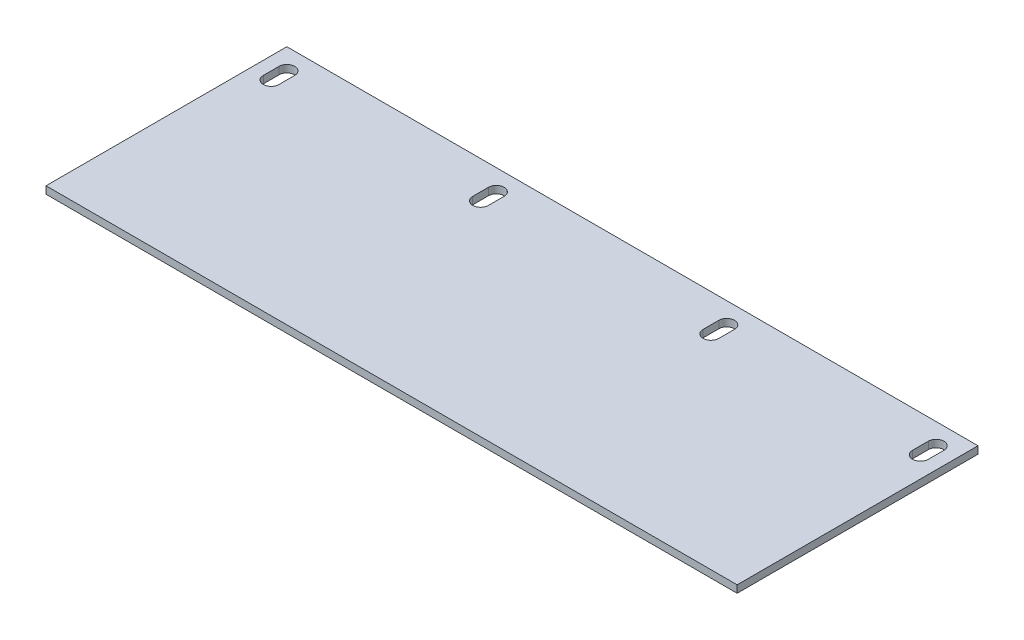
ISO-10303-21;
HEADER;
FILE_DESCRIPTION(('STEP AP214'),'2;1');
FILE_NAME('part.step','',(''),(''),'','','');
FILE_SCHEMA(('AUTOMOTIVE_DESIGN { 1 0 10303 214 1 1 1 1 }'));
ENDSEC;
DATA;
#1=APPLICATION_CONTEXT('core data for automotive mechanical design processes');
#2=APPLICATION_PROTOCOL_DEFINITION('international standard','automotive_design',2000,#1);
#3=PRODUCT_CONTEXT('',#1,'mechanical');
#4=PRODUCT('Part','Part','',(#3));
#5=PRODUCT_RELATED_PRODUCT_CATEGORY('part','',(#4));
#6=PRODUCT_DEFINITION_FORMATION('','',#4);
#7=PRODUCT_DEFINITION_CONTEXT('part definition',#1,'design');
#8=PRODUCT_DEFINITION('design','',#6,#7);
#9=PRODUCT_DEFINITION_SHAPE('','',#8);
#10=(LENGTH_UNIT() NAMED_UNIT(*) SI_UNIT(.MILLI.,.METRE.));
#11=(NAMED_UNIT(*) PLANE_ANGLE_UNIT() SI_UNIT($,.RADIAN.));
#12=(NAMED_UNIT(*) SI_UNIT($,.STERADIAN.) SOLID_ANGLE_UNIT());
#13=UNCERTAINTY_MEASURE_WITH_UNIT(LENGTH_MEASURE(1.E-05),#10,'distance_accuracy_value','');
#14=(GEOMETRIC_REPRESENTATION_CONTEXT(3) GLOBAL_UNCERTAINTY_ASSIGNED_CONTEXT((#13)) GLOBAL_UNIT_ASSIGNED_CONTEXT((#10,
#11,#12)) REPRESENTATION_CONTEXT('',''));
#15=CARTESIAN_POINT('',(0.,0.,0.));
#16=DIRECTION('',(0.,0.,1.));
#17=DIRECTION('',(1.,0.,0.));
#18=AXIS2_PLACEMENT_3D('',#15,#16,#17);
#19=CARTESIAN_POINT('',(838.2,17.8562000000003,-292.1));
#20=DIRECTION('',(-1.,0.,0.));
#21=DIRECTION('',(0.,0.,1.));
#22=AXIS2_PLACEMENT_3D('',#19,#20,#21);
#23=PLANE('',#22);
#24=DIRECTION('',(0.,0.,-1.));
#25=VECTOR('',#24,1.);
#26=CARTESIAN_POINT('',(838.2,3.33066907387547E-13,-292.1));
#27=LINE('',#26,#25);
#28=CARTESIAN_POINT('',(838.2,-4.71844785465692E-13,292.1));
#29=VERTEX_POINT('',#28);
#30=CARTESIAN_POINT('',(838.2,3.33066907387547E-13,-292.1));
#31=VERTEX_POINT('',#30);
#32=EDGE_CURVE('E205',#29,#31,#27,.T.);
#33=ORIENTED_EDGE('',*,*,#32,.T.);
#34=DIRECTION('',(0.,-1.,0.));
#35=VECTOR('',#34,1.);
#36=CARTESIAN_POINT('',(838.2,17.8562000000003,-292.1));
#37=LINE('',#36,#35);
#38=CARTESIAN_POINT('',(838.2,17.8562000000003,-292.1));
#39=VERTEX_POINT('',#38);
#40=EDGE_CURVE('E11',#39,#31,#37,.T.);
#41=ORIENTED_EDGE('',*,*,#40,.F.);
#42=DIRECTION('',(0.,0.,-1.));
#43=VECTOR('',#42,1.);
#44=CARTESIAN_POINT('',(838.2,17.8562000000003,-292.1));
#45=LINE('',#44,#43);
#46=CARTESIAN_POINT('',(838.2,17.8561999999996,292.1));
#47=VERTEX_POINT('',#46);
#48=EDGE_CURVE('E302',#47,#39,#45,.T.);
#49=ORIENTED_EDGE('',*,*,#48,.F.);
#50=DIRECTION('',(0.,-1.,0.));
#51=VECTOR('',#50,1.);
#52=CARTESIAN_POINT('',(838.2,17.8561999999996,292.1));
#53=LINE('',#52,#51);
#54=EDGE_CURVE('E312',#47,#29,#53,.T.);
#55=ORIENTED_EDGE('',*,*,#54,.T.);
#56=EDGE_LOOP('',(#33,#41,#49,#55));
#57=FACE_BOUND('',#56,.T.);
#58=ADVANCED_FACE('F32',(#57),#23,.F.);
#59=CARTESIAN_POINT('',(-838.2,17.8562000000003,-292.1));
#60=DIRECTION('',(0.,0.,1.));
#61=DIRECTION('',(1.,0.,0.));
#62=AXIS2_PLACEMENT_3D('',#59,#60,#61);
#63=PLANE('',#62);
#64=DIRECTION('',(-1.,0.,0.));
#65=VECTOR('',#64,1.);
#66=CARTESIAN_POINT('',(-838.2,3.33066907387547E-13,-292.1));
#67=LINE('',#66,#65);
#68=CARTESIAN_POINT('',(-838.2,3.33066907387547E-13,-292.1));
#69=VERTEX_POINT('',#68);
#70=EDGE_CURVE('E315',#31,#69,#67,.T.);
#71=ORIENTED_EDGE('',*,*,#70,.T.);
#72=DIRECTION('',(0.,-1.,0.));
#73=VECTOR('',#72,1.);
#74=CARTESIAN_POINT('',(-838.2,17.8562000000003,-292.1));
#75=LINE('',#74,#73);
#76=CARTESIAN_POINT('',(-838.2,17.8562000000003,-292.1));
#77=VERTEX_POINT('',#76);
#78=EDGE_CURVE('E39',#77,#69,#75,.T.);
#79=ORIENTED_EDGE('',*,*,#78,.F.);
#80=DIRECTION('',(-1.,0.,0.));
#81=VECTOR('',#80,1.);
#82=CARTESIAN_POINT('',(-838.2,17.8562000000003,-292.1));
#83=LINE('',#82,#81);
#84=EDGE_CURVE('E305',#39,#77,#83,.T.);
#85=ORIENTED_EDGE('',*,*,#84,.F.);
#86=ORIENTED_EDGE('',*,*,#40,.T.);
#87=EDGE_LOOP('',(#71,#79,#85,#86));
#88=FACE_BOUND('',#87,.T.);
#89=ADVANCED_FACE('F344',(#88),#63,.F.);
#90=CARTESIAN_POINT('',(-838.2,17.8562000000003,-292.1));
#91=DIRECTION('',(1.,0.,0.));
#92=DIRECTION('',(0.,0.,-1.));
#93=AXIS2_PLACEMENT_3D('',#90,#91,#92);
#94=PLANE('',#93);
#95=DIRECTION('',(0.,0.,1.));
#96=VECTOR('',#95,1.);
#97=CARTESIAN_POINT('',(-838.2,3.33066907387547E-13,-292.1));
#98=LINE('',#97,#96);
#99=CARTESIAN_POINT('',(-838.2,-4.71844785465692E-13,292.1));
#100=VERTEX_POINT('',#99);
#101=EDGE_CURVE('E317',#69,#100,#98,.T.);
#102=ORIENTED_EDGE('',*,*,#101,.T.);
#103=DIRECTION('',(0.,-1.,0.));
#104=VECTOR('',#103,1.);
#105=CARTESIAN_POINT('',(-838.2,17.8561999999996,292.1));
#106=LINE('',#105,#104);
#107=CARTESIAN_POINT('',(-838.2,17.8561999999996,292.1));
#108=VERTEX_POINT('',#107);
#109=EDGE_CURVE('E322',#108,#100,#106,.T.);
#110=ORIENTED_EDGE('',*,*,#109,.F.);
#111=DIRECTION('',(0.,0.,1.));
#112=VECTOR('',#111,1.);
#113=CARTESIAN_POINT('',(-838.2,17.8562000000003,-292.1));
#114=LINE('',#113,#112);
#115=EDGE_CURVE('E308',#77,#108,#114,.T.);
#116=ORIENTED_EDGE('',*,*,#115,.F.);
#117=ORIENTED_EDGE('',*,*,#78,.T.);
#118=EDGE_LOOP('',(#102,#110,#116,#117));
#119=FACE_BOUND('',#118,.T.);
#120=ADVANCED_FACE('F329',(#119),#94,.F.);
#121=CARTESIAN_POINT('',(-838.2,17.8561999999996,292.1));
#122=DIRECTION('',(0.,0.,-1.));
#123=DIRECTION('',(-1.,0.,0.));
#124=AXIS2_PLACEMENT_3D('',#121,#122,#123);
#125=PLANE('',#124);
#126=DIRECTION('',(1.,0.,0.));
#127=VECTOR('',#126,1.);
#128=CARTESIAN_POINT('',(-838.2,-4.71844785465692E-13,292.1));
#129=LINE('',#128,#127);
#130=EDGE_CURVE('E306',#100,#29,#129,.T.);
#131=ORIENTED_EDGE('',*,*,#130,.T.);
#132=ORIENTED_EDGE('',*,*,#54,.F.);
#133=DIRECTION('',(1.,0.,0.));
#134=VECTOR('',#133,1.);
#135=CARTESIAN_POINT('',(-838.2,17.8561999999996,292.1));
#136=LINE('',#135,#134);
#137=EDGE_CURVE('E310',#108,#47,#136,.T.);
#138=ORIENTED_EDGE('',*,*,#137,.F.);
#139=ORIENTED_EDGE('',*,*,#109,.T.);
#140=EDGE_LOOP('',(#131,#132,#138,#139));
#141=FACE_BOUND('',#140,.T.);
#142=ADVANCED_FACE('F337',(#141),#125,.F.);
#143=CARTESIAN_POINT('',(0.,17.8561999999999,0.));
#144=DIRECTION('',(0.,1.,0.));
#145=DIRECTION('',(0.,0.,1.));
#146=AXIS2_PLACEMENT_3D('',#143,#144,#145);
#147=PLANE('',#146);
#148=CARTESIAN_POINT('',(-787.4,17.8562000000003,-241.3));
#149=DIRECTION('',(0.,1.,0.));
#150=DIRECTION('',(0.,0.,1.));
#151=AXIS2_PLACEMENT_3D('',#148,#149,#150);
#152=CIRCLE('',#151,19.05);
#153=CARTESIAN_POINT('',(-768.35,17.8562000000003,-241.3));
#154=VERTEX_POINT('',#153);
#155=CARTESIAN_POINT('',(-806.45,17.8562000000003,-241.3));
#156=VERTEX_POINT('',#155);
#157=EDGE_CURVE('E46',#154,#156,#152,.T.);
#158=ORIENTED_EDGE('',*,*,#157,.F.);
#159=DIRECTION('',(0.,0.,-1.));
#160=VECTOR('',#159,1.);
#161=CARTESIAN_POINT('',(-768.35,17.8562000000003,-241.3));
#162=LINE('',#161,#160);
#163=CARTESIAN_POINT('',(-768.35,17.8562000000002,-203.2));
#164=VERTEX_POINT('',#163);
#165=EDGE_CURVE('E189',#164,#154,#162,.T.);
#166=ORIENTED_EDGE('',*,*,#165,.F.);
#167=CARTESIAN_POINT('',(-787.4,17.8562000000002,-203.2));
#168=DIRECTION('',(0.,1.,0.));
#169=DIRECTION('',(0.,0.,1.));
#170=AXIS2_PLACEMENT_3D('',#167,#168,#169);
#171=CIRCLE('',#170,19.05);
#172=CARTESIAN_POINT('',(-806.45,17.8562000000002,-203.2));
#173=VERTEX_POINT('',#172);
#174=EDGE_CURVE('E192',#173,#164,#171,.T.);
#175=ORIENTED_EDGE('',*,*,#174,.F.);
#176=DIRECTION('',(0.,0.,1.));
#177=VECTOR('',#176,1.);
#178=CARTESIAN_POINT('',(-806.45,17.8562000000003,-241.3));
#179=LINE('',#178,#177);
#180=EDGE_CURVE('E198',#156,#173,#179,.T.);
#181=ORIENTED_EDGE('',*,*,#180,.F.);
#182=EDGE_LOOP('',(#158,#166,#175,#181));
#183=FACE_BOUND('',#182,.T.);
#184=CARTESIAN_POINT('',(279.4,17.8562000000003,-241.3));
#185=DIRECTION('',(0.,1.,0.));
#186=DIRECTION('',(0.,0.,-1.));
#187=AXIS2_PLACEMENT_3D('',#184,#185,#186);
#188=CIRCLE('',#187,19.0499999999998);
#189=CARTESIAN_POINT('',(298.45,17.8562000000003,-241.3));
#190=VERTEX_POINT('',#189);
#191=CARTESIAN_POINT('',(260.35,17.8562000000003,-241.3));
#192=VERTEX_POINT('',#191);
#193=EDGE_CURVE('E54',#190,#192,#188,.T.);
#194=ORIENTED_EDGE('',*,*,#193,.F.);
#195=DIRECTION('',(0.,0.,-1.));
#196=VECTOR('',#195,1.);
#197=CARTESIAN_POINT('',(298.45,17.8562000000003,-241.3));
#198=LINE('',#197,#196);
#199=CARTESIAN_POINT('',(298.45,17.8562000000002,-203.2));
#200=VERTEX_POINT('',#199);
#201=EDGE_CURVE('E213',#200,#190,#198,.T.);
#202=ORIENTED_EDGE('',*,*,#201,.F.);
#203=CARTESIAN_POINT('',(279.4,17.8562000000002,-203.2));
#204=DIRECTION('',(0.,1.,0.));
#205=DIRECTION('',(0.,0.,-1.));
#206=AXIS2_PLACEMENT_3D('',#203,#204,#205);
#207=CIRCLE('',#206,19.0499999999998);
#208=CARTESIAN_POINT('',(260.35,17.8562000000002,-203.2));
#209=VERTEX_POINT('',#208);
#210=EDGE_CURVE('E228',#209,#200,#207,.T.);
#211=ORIENTED_EDGE('',*,*,#210,.F.);
#212=DIRECTION('',(0.,0.,1.));
#213=VECTOR('',#212,1.);
#214=CARTESIAN_POINT('',(260.35,17.8562000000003,-241.3));
#215=LINE('',#214,#213);
#216=EDGE_CURVE('E224',#192,#209,#215,.T.);
#217=ORIENTED_EDGE('',*,*,#216,.F.);
#218=EDGE_LOOP('',(#194,#202,#211,#217));
#219=FACE_BOUND('',#218,.T.);
#220=CARTESIAN_POINT('',(-279.4,17.8562000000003,-241.3));
#221=DIRECTION('',(0.,1.,0.));
#222=DIRECTION('',(0.,0.,1.));
#223=AXIS2_PLACEMENT_3D('',#220,#221,#222);
#224=CIRCLE('',#223,19.05);
#225=CARTESIAN_POINT('',(-260.35,17.8562000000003,-241.3));
#226=VERTEX_POINT('',#225);
#227=CARTESIAN_POINT('',(-298.45,17.8562000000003,-241.3));
#228=VERTEX_POINT('',#227);
#229=EDGE_CURVE('E253',#226,#228,#224,.T.);
#230=ORIENTED_EDGE('',*,*,#229,.F.);
#231=DIRECTION('',(0.,0.,-1.));
#232=VECTOR('',#231,1.);
#233=CARTESIAN_POINT('',(-260.35,17.8562000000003,-241.3));
#234=LINE('',#233,#232);
#235=CARTESIAN_POINT('',(-260.35,17.8562000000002,-203.2));
#236=VERTEX_POINT('',#235);
#237=EDGE_CURVE('E243',#236,#226,#234,.T.);
#238=ORIENTED_EDGE('',*,*,#237,.F.);
#239=CARTESIAN_POINT('',(-279.4,17.8562000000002,-203.2));
#240=DIRECTION('',(0.,1.,0.));
#241=DIRECTION('',(0.,0.,1.));
#242=AXIS2_PLACEMENT_3D('',#239,#240,#241);
#243=CIRCLE('',#242,19.05);
#244=CARTESIAN_POINT('',(-298.45,17.8562000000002,-203.2));
#245=VERTEX_POINT('',#244);
#246=EDGE_CURVE('E259',#245,#236,#243,.T.);
#247=ORIENTED_EDGE('',*,*,#246,.F.);
#248=DIRECTION('',(0.,0.,1.));
#249=VECTOR('',#248,1.);
#250=CARTESIAN_POINT('',(-298.45,17.8562000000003,-241.3));
#251=LINE('',#250,#249);
#252=EDGE_CURVE('E255',#228,#245,#251,.T.);
#253=ORIENTED_EDGE('',*,*,#252,.F.);
#254=EDGE_LOOP('',(#230,#238,#247,#253));
#255=FACE_BOUND('',#254,.T.);
#256=CARTESIAN_POINT('',(787.4,17.8562000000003,-241.3));
#257=DIRECTION('',(0.,1.,0.));
#258=DIRECTION('',(0.,0.,-1.));
#259=AXIS2_PLACEMENT_3D('',#256,#257,#258);
#260=CIRCLE('',#259,19.05);
#261=CARTESIAN_POINT('',(806.45,17.8562000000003,-241.3));
#262=VERTEX_POINT('',#261);
#263=CARTESIAN_POINT('',(768.35,17.8562000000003,-241.3));
#264=VERTEX_POINT('',#263);
#265=EDGE_CURVE('E285',#262,#264,#260,.T.);
#266=ORIENTED_EDGE('',*,*,#265,.F.);
#267=DIRECTION('',(0.,0.,-1.));
#268=VECTOR('',#267,1.);
#269=CARTESIAN_POINT('',(806.45,17.8562000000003,-241.3));
#270=LINE('',#269,#268);
#271=CARTESIAN_POINT('',(806.45,17.8562000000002,-203.2));
#272=VERTEX_POINT('',#271);
#273=EDGE_CURVE('E275',#272,#262,#270,.T.);
#274=ORIENTED_EDGE('',*,*,#273,.F.);
#275=CARTESIAN_POINT('',(787.4,17.8562000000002,-203.2));
#276=DIRECTION('',(0.,1.,0.));
#277=DIRECTION('',(0.,0.,-1.));
#278=AXIS2_PLACEMENT_3D('',#275,#276,#277);
#279=CIRCLE('',#278,19.05);
#280=CARTESIAN_POINT('',(768.35,17.8562000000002,-203.2));
#281=VERTEX_POINT('',#280);
#282=EDGE_CURVE('E290',#281,#272,#279,.T.);
#283=ORIENTED_EDGE('',*,*,#282,.F.);
#284=DIRECTION('',(0.,0.,1.));
#285=VECTOR('',#284,1.);
#286=CARTESIAN_POINT('',(768.35,17.8562000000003,-241.3));
#287=LINE('',#286,#285);
#288=EDGE_CURVE('E287',#264,#281,#287,.T.);
#289=ORIENTED_EDGE('',*,*,#288,.F.);
#290=EDGE_LOOP('',(#266,#274,#283,#289));
#291=FACE_BOUND('',#290,.T.);
#292=ORIENTED_EDGE('',*,*,#48,.T.);
#293=ORIENTED_EDGE('',*,*,#84,.T.);
#294=ORIENTED_EDGE('',*,*,#115,.T.);
#295=ORIENTED_EDGE('',*,*,#137,.T.);
#296=EDGE_LOOP('',(#292,#293,#294,#295));
#297=FACE_BOUND('',#296,.T.);
#298=ADVANCED_FACE('F343',(#183,#219,#255,#291,#297),#147,.T.);
#299=CARTESIAN_POINT('',(0.,0.,0.));
#300=DIRECTION('',(0.,1.,0.));
#301=DIRECTION('',(0.,0.,1.));
#302=AXIS2_PLACEMENT_3D('',#299,#300,#301);
#303=PLANE('',#302);
#304=DIRECTION('',(0.,0.,-1.));
#305=VECTOR('',#304,1.);
#306=CARTESIAN_POINT('',(-768.35,3.33066907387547E-13,-241.3));
#307=LINE('',#306,#305);
#308=CARTESIAN_POINT('',(-768.35,1.94289029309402E-13,-203.2));
#309=VERTEX_POINT('',#308);
#310=CARTESIAN_POINT('',(-768.35,3.33066907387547E-13,-241.3));
#311=VERTEX_POINT('',#310);
#312=EDGE_CURVE('E176',#309,#311,#307,.T.);
#313=ORIENTED_EDGE('',*,*,#312,.T.);
#314=CARTESIAN_POINT('',(-787.4,3.33066907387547E-13,-241.3));
#315=DIRECTION('',(0.,1.,0.));
#316=DIRECTION('',(0.,0.,1.));
#317=AXIS2_PLACEMENT_3D('',#314,#315,#316);
#318=CIRCLE('',#317,19.05);
#319=CARTESIAN_POINT('',(-806.45,3.33066907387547E-13,-241.3));
#320=VERTEX_POINT('',#319);
#321=EDGE_CURVE('E170',#311,#320,#318,.T.);
#322=ORIENTED_EDGE('',*,*,#321,.T.);
#323=DIRECTION('',(0.,0.,1.));
#324=VECTOR('',#323,1.);
#325=CARTESIAN_POINT('',(-806.45,3.33066907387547E-13,-241.3));
#326=LINE('',#325,#324);
#327=CARTESIAN_POINT('',(-806.45,1.94289029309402E-13,-203.2));
#328=VERTEX_POINT('',#327);
#329=EDGE_CURVE('E180',#320,#328,#326,.T.);
#330=ORIENTED_EDGE('',*,*,#329,.T.);
#331=CARTESIAN_POINT('',(-787.4,1.94289029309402E-13,-203.2));
#332=DIRECTION('',(0.,1.,0.));
#333=DIRECTION('',(0.,0.,1.));
#334=AXIS2_PLACEMENT_3D('',#331,#332,#333);
#335=CIRCLE('',#334,19.05);
#336=EDGE_CURVE('E184',#328,#309,#335,.T.);
#337=ORIENTED_EDGE('',*,*,#336,.T.);
#338=EDGE_LOOP('',(#313,#322,#330,#337));
#339=FACE_BOUND('',#338,.T.);
#340=DIRECTION('',(0.,0.,-1.));
#341=VECTOR('',#340,1.);
#342=CARTESIAN_POINT('',(298.45,3.33066907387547E-13,-241.3));
#343=LINE('',#342,#341);
#344=CARTESIAN_POINT('',(298.45,1.94289029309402E-13,-203.2));
#345=VERTEX_POINT('',#344);
#346=CARTESIAN_POINT('',(298.45,3.33066907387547E-13,-241.3));
#347=VERTEX_POINT('',#346);
#348=EDGE_CURVE('E219',#345,#347,#343,.T.);
#349=ORIENTED_EDGE('',*,*,#348,.T.);
#350=CARTESIAN_POINT('',(279.4,3.33066907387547E-13,-241.3));
#351=DIRECTION('',(0.,1.,0.));
#352=DIRECTION('',(0.,0.,-1.));
#353=AXIS2_PLACEMENT_3D('',#350,#351,#352);
#354=CIRCLE('',#353,19.0499999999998);
#355=CARTESIAN_POINT('',(260.35,3.33066907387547E-13,-241.3));
#356=VERTEX_POINT('',#355);
#357=EDGE_CURVE('E209',#347,#356,#354,.T.);
#358=ORIENTED_EDGE('',*,*,#357,.T.);
#359=DIRECTION('',(0.,0.,1.));
#360=VECTOR('',#359,1.);
#361=CARTESIAN_POINT('',(260.35,3.33066907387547E-13,-241.3));
#362=LINE('',#361,#360);
#363=CARTESIAN_POINT('',(260.35,1.94289029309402E-13,-203.2));
#364=VERTEX_POINT('',#363);
#365=EDGE_CURVE('E212',#356,#364,#362,.T.);
#366=ORIENTED_EDGE('',*,*,#365,.T.);
#367=CARTESIAN_POINT('',(279.4,1.94289029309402E-13,-203.2));
#368=DIRECTION('',(0.,1.,0.));
#369=DIRECTION('',(0.,0.,-1.));
#370=AXIS2_PLACEMENT_3D('',#367,#368,#369);
#371=CIRCLE('',#370,19.0499999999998);
#372=EDGE_CURVE('E216',#364,#345,#371,.T.);
#373=ORIENTED_EDGE('',*,*,#372,.T.);
#374=EDGE_LOOP('',(#349,#358,#366,#373));
#375=FACE_BOUND('',#374,.T.);
#376=DIRECTION('',(0.,0.,-1.));
#377=VECTOR('',#376,1.);
#378=CARTESIAN_POINT('',(-260.35,3.33066907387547E-13,-241.3));
#379=LINE('',#378,#377);
#380=CARTESIAN_POINT('',(-260.35,1.94289029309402E-13,-203.2));
#381=VERTEX_POINT('',#380);
#382=CARTESIAN_POINT('',(-260.35,3.33066907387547E-13,-241.3));
#383=VERTEX_POINT('',#382);
#384=EDGE_CURVE('E249',#381,#383,#379,.T.);
#385=ORIENTED_EDGE('',*,*,#384,.T.);
#386=CARTESIAN_POINT('',(-279.4,3.33066907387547E-13,-241.3));
#387=DIRECTION('',(0.,1.,0.));
#388=DIRECTION('',(0.,0.,1.));
#389=AXIS2_PLACEMENT_3D('',#386,#387,#388);
#390=CIRCLE('',#389,19.05);
#391=CARTESIAN_POINT('',(-298.45,3.33066907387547E-13,-241.3));
#392=VERTEX_POINT('',#391);
#393=EDGE_CURVE('E239',#383,#392,#390,.T.);
#394=ORIENTED_EDGE('',*,*,#393,.T.);
#395=DIRECTION('',(0.,0.,1.));
#396=VECTOR('',#395,1.);
#397=CARTESIAN_POINT('',(-298.45,3.33066907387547E-13,-241.3));
#398=LINE('',#397,#396);
#399=CARTESIAN_POINT('',(-298.45,1.94289029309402E-13,-203.2));
#400=VERTEX_POINT('',#399);
#401=EDGE_CURVE('E242',#392,#400,#398,.T.);
#402=ORIENTED_EDGE('',*,*,#401,.T.);
#403=CARTESIAN_POINT('',(-279.4,1.94289029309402E-13,-203.2));
#404=DIRECTION('',(0.,1.,0.));
#405=DIRECTION('',(0.,0.,1.));
#406=AXIS2_PLACEMENT_3D('',#403,#404,#405);
#407=CIRCLE('',#406,19.05);
#408=EDGE_CURVE('E246',#400,#381,#407,.T.);
#409=ORIENTED_EDGE('',*,*,#408,.T.);
#410=EDGE_LOOP('',(#385,#394,#402,#409));
#411=FACE_BOUND('',#410,.T.);
#412=DIRECTION('',(0.,0.,-1.));
#413=VECTOR('',#412,1.);
#414=CARTESIAN_POINT('',(806.45,3.33066907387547E-13,-241.3));
#415=LINE('',#414,#413);
#416=CARTESIAN_POINT('',(806.45,1.94289029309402E-13,-203.2));
#417=VERTEX_POINT('',#416);
#418=CARTESIAN_POINT('',(806.45,3.33066907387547E-13,-241.3));
#419=VERTEX_POINT('',#418);
#420=EDGE_CURVE('E281',#417,#419,#415,.T.);
#421=ORIENTED_EDGE('',*,*,#420,.T.);
#422=CARTESIAN_POINT('',(787.4,3.33066907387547E-13,-241.3));
#423=DIRECTION('',(0.,1.,0.));
#424=DIRECTION('',(0.,0.,-1.));
#425=AXIS2_PLACEMENT_3D('',#422,#423,#424);
#426=CIRCLE('',#425,19.05);
#427=CARTESIAN_POINT('',(768.35,3.33066907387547E-13,-241.3));
#428=VERTEX_POINT('',#427);
#429=EDGE_CURVE('E271',#419,#428,#426,.T.);
#430=ORIENTED_EDGE('',*,*,#429,.T.);
#431=DIRECTION('',(0.,0.,1.));
#432=VECTOR('',#431,1.);
#433=CARTESIAN_POINT('',(768.35,3.33066907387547E-13,-241.3));
#434=LINE('',#433,#432);
#435=CARTESIAN_POINT('',(768.35,1.94289029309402E-13,-203.2));
#436=VERTEX_POINT('',#435);
#437=EDGE_CURVE('E274',#428,#436,#434,.T.);
#438=ORIENTED_EDGE('',*,*,#437,.T.);
#439=CARTESIAN_POINT('',(787.4,1.94289029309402E-13,-203.2));
#440=DIRECTION('',(0.,1.,0.));
#441=DIRECTION('',(0.,0.,-1.));
#442=AXIS2_PLACEMENT_3D('',#439,#440,#441);
#443=CIRCLE('',#442,19.05);
#444=EDGE_CURVE('E278',#436,#417,#443,.T.);
#445=ORIENTED_EDGE('',*,*,#444,.T.);
#446=EDGE_LOOP('',(#421,#430,#438,#445));
#447=FACE_BOUND('',#446,.T.);
#448=ORIENTED_EDGE('',*,*,#32,.F.);
#449=ORIENTED_EDGE('',*,*,#130,.F.);
#450=ORIENTED_EDGE('',*,*,#101,.F.);
#451=ORIENTED_EDGE('',*,*,#70,.F.);
#452=EDGE_LOOP('',(#448,#449,#450,#451));
#453=FACE_BOUND('',#452,.T.);
#454=ADVANCED_FACE('F186',(#339,#375,#411,#447,#453),#303,.F.);
#455=CARTESIAN_POINT('',(787.4,3.33066907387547E-13,-241.3));
#456=DIRECTION('',(0.,1.,0.));
#457=DIRECTION('',(0.,0.,1.));
#458=AXIS2_PLACEMENT_3D('',#455,#456,#457);
#459=CYLINDRICAL_SURFACE('',#458,19.05);
#460=ORIENTED_EDGE('',*,*,#265,.T.);
#461=DIRECTION('',(0.,1.,0.));
#462=VECTOR('',#461,1.);
#463=CARTESIAN_POINT('',(768.35,3.33066907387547E-13,-241.3));
#464=LINE('',#463,#462);
#465=EDGE_CURVE('E284',#428,#264,#464,.T.);
#466=ORIENTED_EDGE('',*,*,#465,.F.);
#467=ORIENTED_EDGE('',*,*,#429,.F.);
#468=DIRECTION('',(0.,1.,0.));
#469=VECTOR('',#468,1.);
#470=CARTESIAN_POINT('',(806.45,3.33066907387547E-13,-241.3));
#471=LINE('',#470,#469);
#472=EDGE_CURVE('E256',#419,#262,#471,.T.);
#473=ORIENTED_EDGE('',*,*,#472,.T.);
#474=EDGE_LOOP('',(#460,#466,#467,#473));
#475=FACE_BOUND('',#474,.T.);
#476=ADVANCED_FACE('F356',(#475),#459,.F.);
#477=CARTESIAN_POINT('',(806.45,3.33066907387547E-13,-241.3));
#478=DIRECTION('',(1.,0.,0.));
#479=DIRECTION('',(0.,0.,-1.));
#480=AXIS2_PLACEMENT_3D('',#477,#478,#479);
#481=PLANE('',#480);
#482=ORIENTED_EDGE('',*,*,#273,.T.);
#483=ORIENTED_EDGE('',*,*,#472,.F.);
#484=ORIENTED_EDGE('',*,*,#420,.F.);
#485=DIRECTION('',(0.,1.,0.));
#486=VECTOR('',#485,1.);
#487=CARTESIAN_POINT('',(806.45,1.94289029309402E-13,-203.2));
#488=LINE('',#487,#486);
#489=EDGE_CURVE('E296',#417,#272,#488,.T.);
#490=ORIENTED_EDGE('',*,*,#489,.T.);
#491=EDGE_LOOP('',(#482,#483,#484,#490));
#492=FACE_BOUND('',#491,.T.);
#493=ADVANCED_FACE('F362',(#492),#481,.F.);
#494=CARTESIAN_POINT('',(787.4,1.94289029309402E-13,-203.2));
#495=DIRECTION('',(0.,1.,0.));
#496=DIRECTION('',(0.,0.,1.));
#497=AXIS2_PLACEMENT_3D('',#494,#495,#496);
#498=CYLINDRICAL_SURFACE('',#497,19.05);
#499=ORIENTED_EDGE('',*,*,#282,.T.);
#500=ORIENTED_EDGE('',*,*,#489,.F.);
#501=ORIENTED_EDGE('',*,*,#444,.F.);
#502=DIRECTION('',(0.,1.,0.));
#503=VECTOR('',#502,1.);
#504=CARTESIAN_POINT('',(768.35,1.94289029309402E-13,-203.2));
#505=LINE('',#504,#503);
#506=EDGE_CURVE('E298',#436,#281,#505,.T.);
#507=ORIENTED_EDGE('',*,*,#506,.T.);
#508=EDGE_LOOP('',(#499,#500,#501,#507));
#509=FACE_BOUND('',#508,.T.);
#510=ADVANCED_FACE('F368',(#509),#498,.F.);
#511=CARTESIAN_POINT('',(768.35,3.33066907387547E-13,-241.3));
#512=DIRECTION('',(-1.,0.,0.));
#513=DIRECTION('',(0.,0.,1.));
#514=AXIS2_PLACEMENT_3D('',#511,#512,#513);
#515=PLANE('',#514);
#516=ORIENTED_EDGE('',*,*,#288,.T.);
#517=ORIENTED_EDGE('',*,*,#506,.F.);
#518=ORIENTED_EDGE('',*,*,#437,.F.);
#519=ORIENTED_EDGE('',*,*,#465,.T.);
#520=EDGE_LOOP('',(#516,#517,#518,#519));
#521=FACE_BOUND('',#520,.T.);
#522=ADVANCED_FACE('F364',(#521),#515,.F.);
#523=CARTESIAN_POINT('',(-279.4,3.33066907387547E-13,-241.3));
#524=DIRECTION('',(0.,1.,0.));
#525=DIRECTION('',(0.,0.,1.));
#526=AXIS2_PLACEMENT_3D('',#523,#524,#525);
#527=CYLINDRICAL_SURFACE('',#526,19.05);
#528=ORIENTED_EDGE('',*,*,#229,.T.);
#529=DIRECTION('',(0.,1.,0.));
#530=VECTOR('',#529,1.);
#531=CARTESIAN_POINT('',(-298.45,3.33066907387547E-13,-241.3));
#532=LINE('',#531,#530);
#533=EDGE_CURVE('E252',#392,#228,#532,.T.);
#534=ORIENTED_EDGE('',*,*,#533,.F.);
#535=ORIENTED_EDGE('',*,*,#393,.F.);
#536=DIRECTION('',(0.,1.,0.));
#537=VECTOR('',#536,1.);
#538=CARTESIAN_POINT('',(-260.35,3.33066907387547E-13,-241.3));
#539=LINE('',#538,#537);
#540=EDGE_CURVE('E225',#383,#226,#539,.T.);
#541=ORIENTED_EDGE('',*,*,#540,.T.);
#542=EDGE_LOOP('',(#528,#534,#535,#541));
#543=FACE_BOUND('',#542,.T.);
#544=ADVANCED_FACE('F367',(#543),#527,.F.);
#545=CARTESIAN_POINT('',(-260.35,3.33066907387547E-13,-241.3));
#546=DIRECTION('',(1.,0.,0.));
#547=DIRECTION('',(0.,0.,-1.));
#548=AXIS2_PLACEMENT_3D('',#545,#546,#547);
#549=PLANE('',#548);
#550=ORIENTED_EDGE('',*,*,#237,.T.);
#551=ORIENTED_EDGE('',*,*,#540,.F.);
#552=ORIENTED_EDGE('',*,*,#384,.F.);
#553=DIRECTION('',(0.,1.,0.));
#554=VECTOR('',#553,1.);
#555=CARTESIAN_POINT('',(-260.35,1.94289029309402E-13,-203.2));
#556=LINE('',#555,#554);
#557=EDGE_CURVE('E265',#381,#236,#556,.T.);
#558=ORIENTED_EDGE('',*,*,#557,.T.);
#559=EDGE_LOOP('',(#550,#551,#552,#558));
#560=FACE_BOUND('',#559,.T.);
#561=ADVANCED_FACE('F378',(#560),#549,.F.);
#562=CARTESIAN_POINT('',(-279.4,1.94289029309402E-13,-203.2));
#563=DIRECTION('',(0.,1.,0.));
#564=DIRECTION('',(0.,0.,1.));
#565=AXIS2_PLACEMENT_3D('',#562,#563,#564);
#566=CYLINDRICAL_SURFACE('',#565,19.05);
#567=ORIENTED_EDGE('',*,*,#246,.T.);
#568=ORIENTED_EDGE('',*,*,#557,.F.);
#569=ORIENTED_EDGE('',*,*,#408,.F.);
#570=DIRECTION('',(0.,1.,0.));
#571=VECTOR('',#570,1.);
#572=CARTESIAN_POINT('',(-298.45,1.94289029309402E-13,-203.2));
#573=LINE('',#572,#571);
#574=EDGE_CURVE('E267',#400,#245,#573,.T.);
#575=ORIENTED_EDGE('',*,*,#574,.T.);
#576=EDGE_LOOP('',(#567,#568,#569,#575));
#577=FACE_BOUND('',#576,.T.);
#578=ADVANCED_FACE('F384',(#577),#566,.F.);
#579=CARTESIAN_POINT('',(-298.45,3.33066907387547E-13,-241.3));
#580=DIRECTION('',(-1.,0.,0.));
#581=DIRECTION('',(0.,0.,1.));
#582=AXIS2_PLACEMENT_3D('',#579,#580,#581);
#583=PLANE('',#582);
#584=ORIENTED_EDGE('',*,*,#252,.T.);
#585=ORIENTED_EDGE('',*,*,#574,.F.);
#586=ORIENTED_EDGE('',*,*,#401,.F.);
#587=ORIENTED_EDGE('',*,*,#533,.T.);
#588=EDGE_LOOP('',(#584,#585,#586,#587));
#589=FACE_BOUND('',#588,.T.);
#590=ADVANCED_FACE('F380',(#589),#583,.F.);
#591=CARTESIAN_POINT('',(279.4,3.33066907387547E-13,-241.3));
#592=DIRECTION('',(0.,1.,0.));
#593=DIRECTION('',(0.,0.,1.));
#594=AXIS2_PLACEMENT_3D('',#591,#592,#593);
#595=CYLINDRICAL_SURFACE('',#594,19.0499999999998);
#596=ORIENTED_EDGE('',*,*,#193,.T.);
#597=DIRECTION('',(0.,1.,0.));
#598=VECTOR('',#597,1.);
#599=CARTESIAN_POINT('',(260.35,3.33066907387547E-13,-241.3));
#600=LINE('',#599,#598);
#601=EDGE_CURVE('E222',#356,#192,#600,.T.);
#602=ORIENTED_EDGE('',*,*,#601,.F.);
#603=ORIENTED_EDGE('',*,*,#357,.F.);
#604=DIRECTION('',(0.,1.,0.));
#605=VECTOR('',#604,1.);
#606=CARTESIAN_POINT('',(298.45,3.33066907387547E-13,-241.3));
#607=LINE('',#606,#605);
#608=EDGE_CURVE('E199',#347,#190,#607,.T.);
#609=ORIENTED_EDGE('',*,*,#608,.T.);
#610=EDGE_LOOP('',(#596,#602,#603,#609));
#611=FACE_BOUND('',#610,.T.);
#612=ADVANCED_FACE('F383',(#611),#595,.F.);
#613=CARTESIAN_POINT('',(298.45,3.33066907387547E-13,-241.3));
#614=DIRECTION('',(1.,0.,0.));
#615=DIRECTION('',(0.,0.,-1.));
#616=AXIS2_PLACEMENT_3D('',#613,#614,#615);
#617=PLANE('',#616);
#618=ORIENTED_EDGE('',*,*,#201,.T.);
#619=ORIENTED_EDGE('',*,*,#608,.F.);
#620=ORIENTED_EDGE('',*,*,#348,.F.);
#621=DIRECTION('',(0.,1.,0.));
#622=VECTOR('',#621,1.);
#623=CARTESIAN_POINT('',(298.45,1.94289029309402E-13,-203.2));
#624=LINE('',#623,#622);
#625=EDGE_CURVE('E234',#345,#200,#624,.T.);
#626=ORIENTED_EDGE('',*,*,#625,.T.);
#627=EDGE_LOOP('',(#618,#619,#620,#626));
#628=FACE_BOUND('',#627,.T.);
#629=ADVANCED_FACE('F394',(#628),#617,.F.);
#630=CARTESIAN_POINT('',(279.4,1.94289029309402E-13,-203.2));
#631=DIRECTION('',(0.,1.,0.));
#632=DIRECTION('',(0.,0.,1.));
#633=AXIS2_PLACEMENT_3D('',#630,#631,#632);
#634=CYLINDRICAL_SURFACE('',#633,19.0499999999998);
#635=ORIENTED_EDGE('',*,*,#210,.T.);
#636=ORIENTED_EDGE('',*,*,#625,.F.);
#637=ORIENTED_EDGE('',*,*,#372,.F.);
#638=DIRECTION('',(0.,1.,0.));
#639=VECTOR('',#638,1.);
#640=CARTESIAN_POINT('',(260.35,1.94289029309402E-13,-203.2));
#641=LINE('',#640,#639);
#642=EDGE_CURVE('E236',#364,#209,#641,.T.);
#643=ORIENTED_EDGE('',*,*,#642,.T.);
#644=EDGE_LOOP('',(#635,#636,#637,#643));
#645=FACE_BOUND('',#644,.T.);
#646=ADVANCED_FACE('F398',(#645),#634,.F.);
#647=CARTESIAN_POINT('',(260.35,3.33066907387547E-13,-241.3));
#648=DIRECTION('',(-1.,0.,0.));
#649=DIRECTION('',(0.,0.,1.));
#650=AXIS2_PLACEMENT_3D('',#647,#648,#649);
#651=PLANE('',#650);
#652=ORIENTED_EDGE('',*,*,#216,.T.);
#653=ORIENTED_EDGE('',*,*,#642,.F.);
#654=ORIENTED_EDGE('',*,*,#365,.F.);
#655=ORIENTED_EDGE('',*,*,#601,.T.);
#656=EDGE_LOOP('',(#652,#653,#654,#655));
#657=FACE_BOUND('',#656,.T.);
#658=ADVANCED_FACE('F395',(#657),#651,.F.);
#659=CARTESIAN_POINT('',(-787.4,3.33066907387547E-13,-241.3));
#660=DIRECTION('',(0.,1.,0.));
#661=DIRECTION('',(0.,0.,1.));
#662=AXIS2_PLACEMENT_3D('',#659,#660,#661);
#663=CYLINDRICAL_SURFACE('',#662,19.05);
#664=ORIENTED_EDGE('',*,*,#157,.T.);
#665=DIRECTION('',(0.,1.,0.));
#666=VECTOR('',#665,1.);
#667=CARTESIAN_POINT('',(-806.45,3.33066907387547E-13,-241.3));
#668=LINE('',#667,#666);
#669=EDGE_CURVE('E166',#320,#156,#668,.T.);
#670=ORIENTED_EDGE('',*,*,#669,.F.);
#671=ORIENTED_EDGE('',*,*,#321,.F.);
#672=DIRECTION('',(0.,1.,0.));
#673=VECTOR('',#672,1.);
#674=CARTESIAN_POINT('',(-768.35,3.33066907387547E-13,-241.3));
#675=LINE('',#674,#673);
#676=EDGE_CURVE('E203',#311,#154,#675,.T.);
#677=ORIENTED_EDGE('',*,*,#676,.T.);
#678=EDGE_LOOP('',(#664,#670,#671,#677));
#679=FACE_BOUND('',#678,.T.);
#680=ADVANCED_FACE('F168',(#679),#663,.F.);
#681=CARTESIAN_POINT('',(-768.35,3.33066907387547E-13,-241.3));
#682=DIRECTION('',(1.,0.,0.));
#683=DIRECTION('',(0.,0.,-1.));
#684=AXIS2_PLACEMENT_3D('',#681,#682,#683);
#685=PLANE('',#684);
#686=ORIENTED_EDGE('',*,*,#165,.T.);
#687=ORIENTED_EDGE('',*,*,#676,.F.);
#688=ORIENTED_EDGE('',*,*,#312,.F.);
#689=DIRECTION('',(0.,1.,0.));
#690=VECTOR('',#689,1.);
#691=CARTESIAN_POINT('',(-768.35,1.94289029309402E-13,-203.2));
#692=LINE('',#691,#690);
#693=EDGE_CURVE('E206',#309,#164,#692,.T.);
#694=ORIENTED_EDGE('',*,*,#693,.T.);
#695=EDGE_LOOP('',(#686,#687,#688,#694));
#696=FACE_BOUND('',#695,.T.);
#697=ADVANCED_FACE('F408',(#696),#685,.F.);
#698=CARTESIAN_POINT('',(-787.4,1.94289029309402E-13,-203.2));
#699=DIRECTION('',(0.,1.,0.));
#700=DIRECTION('',(0.,0.,1.));
#701=AXIS2_PLACEMENT_3D('',#698,#699,#700);
#702=CYLINDRICAL_SURFACE('',#701,19.05);
#703=ORIENTED_EDGE('',*,*,#174,.T.);
#704=ORIENTED_EDGE('',*,*,#693,.F.);
#705=ORIENTED_EDGE('',*,*,#336,.F.);
#706=DIRECTION('',(0.,1.,0.));
#707=VECTOR('',#706,1.);
#708=CARTESIAN_POINT('',(-806.45,1.94289029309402E-13,-203.2));
#709=LINE('',#708,#707);
#710=EDGE_CURVE('E175',#328,#173,#709,.T.);
#711=ORIENTED_EDGE('',*,*,#710,.T.);
#712=EDGE_LOOP('',(#703,#704,#705,#711));
#713=FACE_BOUND('',#712,.T.);
#714=ADVANCED_FACE('F411',(#713),#702,.F.);
#715=CARTESIAN_POINT('',(-806.45,3.33066907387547E-13,-241.3));
#716=DIRECTION('',(-1.,0.,0.));
#717=DIRECTION('',(0.,0.,1.));
#718=AXIS2_PLACEMENT_3D('',#715,#716,#717);
#719=PLANE('',#718);
#720=ORIENTED_EDGE('',*,*,#180,.T.);
#721=ORIENTED_EDGE('',*,*,#710,.F.);
#722=ORIENTED_EDGE('',*,*,#329,.F.);
#723=ORIENTED_EDGE('',*,*,#669,.T.);
#724=EDGE_LOOP('',(#720,#721,#722,#723));
#725=FACE_BOUND('',#724,.T.);
#726=ADVANCED_FACE('F181',(#725),#719,.F.);
#727=CLOSED_SHELL('',(#58,#89,#120,#142,#298,#454,#476,#493,#510,#522,#544,#561,#578,#590,#612,
#629,#646,#658,#680,#697,#714,#726));
#728=MANIFOLD_SOLID_BREP('B2',#727);
#729=ADVANCED_BREP_SHAPE_REPRESENTATION('',(#18,#728),#14);
#730=SHAPE_DEFINITION_REPRESENTATION(#9,#729);
ENDSEC;
END-ISO-10303-21;
